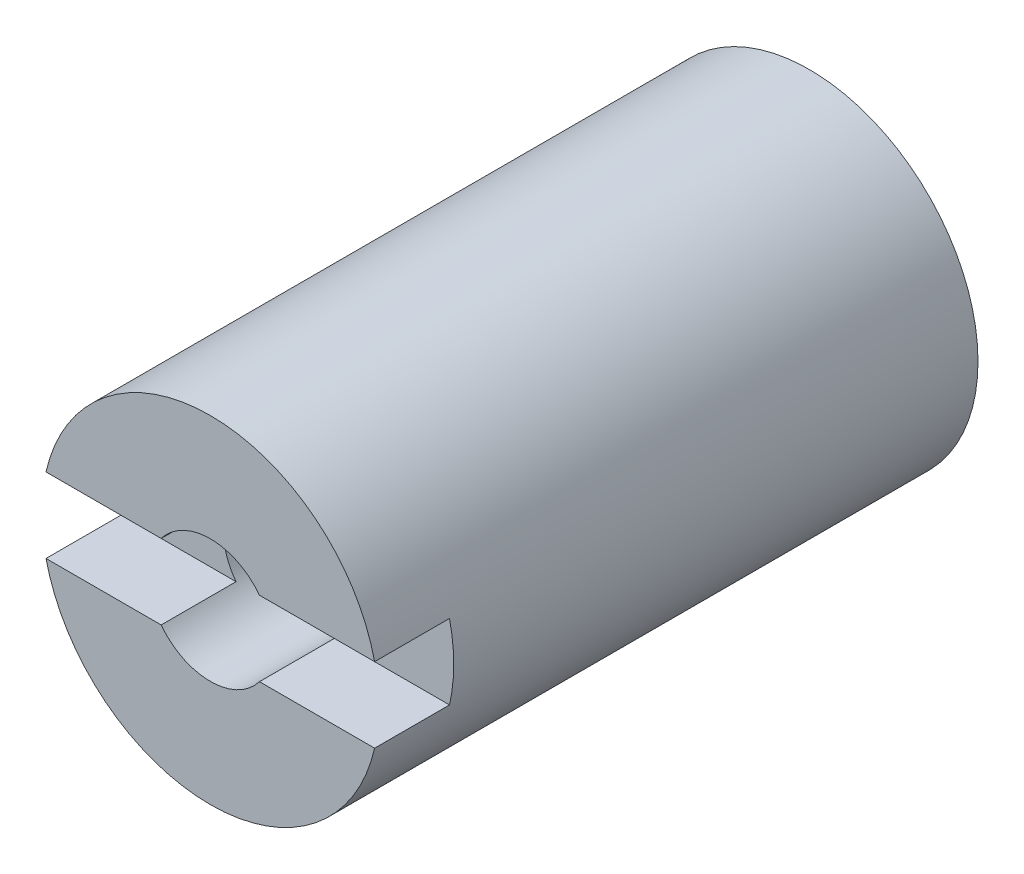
ISO-10303-21;
HEADER;
FILE_DESCRIPTION(('STEP AP214'),'2;1');
FILE_NAME('part.step','',(''),(''),'','','');
FILE_SCHEMA(('AUTOMOTIVE_DESIGN { 1 0 10303 214 1 1 1 1 }'));
ENDSEC;
DATA;
#1=APPLICATION_CONTEXT('core data for automotive mechanical design processes');
#2=APPLICATION_PROTOCOL_DEFINITION('international standard','automotive_design',2000,#1);
#3=PRODUCT_CONTEXT('',#1,'mechanical');
#4=PRODUCT('Part','Part','',(#3));
#5=PRODUCT_RELATED_PRODUCT_CATEGORY('part','',(#4));
#6=PRODUCT_DEFINITION_FORMATION('','',#4);
#7=PRODUCT_DEFINITION_CONTEXT('part definition',#1,'design');
#8=PRODUCT_DEFINITION('design','',#6,#7);
#9=PRODUCT_DEFINITION_SHAPE('','',#8);
#10=(LENGTH_UNIT() NAMED_UNIT(*) SI_UNIT(.MILLI.,.METRE.));
#11=(NAMED_UNIT(*) PLANE_ANGLE_UNIT() SI_UNIT($,.RADIAN.));
#12=(NAMED_UNIT(*) SI_UNIT($,.STERADIAN.) SOLID_ANGLE_UNIT());
#13=UNCERTAINTY_MEASURE_WITH_UNIT(LENGTH_MEASURE(1.E-05),#10,'distance_accuracy_value','');
#14=(GEOMETRIC_REPRESENTATION_CONTEXT(3) GLOBAL_UNCERTAINTY_ASSIGNED_CONTEXT((#13)) GLOBAL_UNIT_ASSIGNED_CONTEXT((#10,
#11,#12)) REPRESENTATION_CONTEXT('',''));
#15=CARTESIAN_POINT('',(0.,0.,0.));
#16=DIRECTION('',(0.,0.,1.));
#17=DIRECTION('',(1.,0.,0.));
#18=AXIS2_PLACEMENT_3D('',#15,#16,#17);
#19=CARTESIAN_POINT('',(0.,0.,0.));
#20=DIRECTION('',(0.,0.,1.));
#21=DIRECTION('',(1.,0.,0.));
#22=AXIS2_PLACEMENT_3D('',#19,#20,#21);
#23=PLANE('',#22);
#24=DIRECTION('',(-1.,0.,0.));
#25=VECTOR('',#24,1.);
#26=CARTESIAN_POINT('',(-4.38748219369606,1.,0.));
#27=LINE('',#26,#25);
#28=CARTESIAN_POINT('',(4.38748219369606,1.,0.));
#29=VERTEX_POINT('',#28);
#30=CARTESIAN_POINT('',(1.31244047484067,0.999999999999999,0.));
#31=VERTEX_POINT('',#30);
#32=EDGE_CURVE('E165',#29,#31,#27,.T.);
#33=ORIENTED_EDGE('',*,*,#32,.F.);
#34=CARTESIAN_POINT('',(0.,0.,0.));
#35=DIRECTION('',(0.,0.,1.));
#36=DIRECTION('',(1.,0.,0.));
#37=AXIS2_PLACEMENT_3D('',#34,#35,#36);
#38=CIRCLE('',#37,4.5);
#39=CARTESIAN_POINT('',(-4.38748219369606,1.,0.));
#40=VERTEX_POINT('',#39);
#41=EDGE_CURVE('E128',#29,#40,#38,.T.);
#42=ORIENTED_EDGE('',*,*,#41,.T.);
#43=CARTESIAN_POINT('',(-1.31244047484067,0.999999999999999,0.));
#44=VERTEX_POINT('',#43);
#45=EDGE_CURVE('E120',#44,#40,#27,.T.);
#46=ORIENTED_EDGE('',*,*,#45,.F.);
#47=CARTESIAN_POINT('',(0.,0.,0.));
#48=DIRECTION('',(0.,0.,1.));
#49=DIRECTION('',(1.,0.,0.));
#50=AXIS2_PLACEMENT_3D('',#47,#48,#49);
#51=CIRCLE('',#50,1.65);
#52=EDGE_CURVE('E129',#31,#44,#51,.T.);
#53=ORIENTED_EDGE('',*,*,#52,.F.);
#54=EDGE_LOOP('',(#33,#42,#46,#53));
#55=FACE_BOUND('',#54,.T.);
#56=ADVANCED_FACE('F38',(#55),#23,.T.);
#57=CARTESIAN_POINT('',(0.,0.,-16.));
#58=DIRECTION('',(0.,0.,1.));
#59=DIRECTION('',(1.,0.,0.));
#60=AXIS2_PLACEMENT_3D('',#57,#58,#59);
#61=CYLINDRICAL_SURFACE('',#60,4.5);
#62=DIRECTION('',(0.,0.,1.));
#63=VECTOR('',#62,1.);
#64=CARTESIAN_POINT('',(-4.38748219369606,1.,-2.));
#65=LINE('',#64,#63);
#66=CARTESIAN_POINT('',(-4.38748219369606,1.,-2.));
#67=VERTEX_POINT('',#66);
#68=EDGE_CURVE('E156',#67,#40,#65,.T.);
#69=ORIENTED_EDGE('',*,*,#68,.T.);
#70=ORIENTED_EDGE('',*,*,#41,.F.);
#71=DIRECTION('',(0.,0.,1.));
#72=VECTOR('',#71,1.);
#73=CARTESIAN_POINT('',(4.38748219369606,1.,-2.));
#74=LINE('',#73,#72);
#75=CARTESIAN_POINT('',(4.38748219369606,1.,-2.));
#76=VERTEX_POINT('',#75);
#77=EDGE_CURVE('E176',#76,#29,#74,.T.);
#78=ORIENTED_EDGE('',*,*,#77,.F.);
#79=CARTESIAN_POINT('',(0.,0.,-2.));
#80=DIRECTION('',(0.,0.,1.));
#81=DIRECTION('',(1.,0.,0.));
#82=AXIS2_PLACEMENT_3D('',#79,#80,#81);
#83=CIRCLE('',#82,4.5);
#84=CARTESIAN_POINT('',(4.38748219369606,-1.,-2.));
#85=VERTEX_POINT('',#84);
#86=EDGE_CURVE('E157',#85,#76,#83,.T.);
#87=ORIENTED_EDGE('',*,*,#86,.F.);
#88=DIRECTION('',(0.,0.,1.));
#89=VECTOR('',#88,1.);
#90=CARTESIAN_POINT('',(4.38748219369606,-1.,-2.));
#91=LINE('',#90,#89);
#92=CARTESIAN_POINT('',(4.38748219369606,-1.,0.));
#93=VERTEX_POINT('',#92);
#94=EDGE_CURVE('E110',#85,#93,#91,.T.);
#95=ORIENTED_EDGE('',*,*,#94,.T.);
#96=CARTESIAN_POINT('',(-4.38748219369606,-1.,0.));
#97=VERTEX_POINT('',#96);
#98=EDGE_CURVE('E117',#97,#93,#38,.T.);
#99=ORIENTED_EDGE('',*,*,#98,.F.);
#100=DIRECTION('',(0.,0.,1.));
#101=VECTOR('',#100,1.);
#102=CARTESIAN_POINT('',(-4.38748219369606,-1.,-2.));
#103=LINE('',#102,#101);
#104=CARTESIAN_POINT('',(-4.38748219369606,-1.,-2.));
#105=VERTEX_POINT('',#104);
#106=EDGE_CURVE('E102',#105,#97,#103,.T.);
#107=ORIENTED_EDGE('',*,*,#106,.F.);
#108=CARTESIAN_POINT('',(0.,0.,-2.));
#109=DIRECTION('',(0.,0.,1.));
#110=DIRECTION('',(1.,0.,0.));
#111=AXIS2_PLACEMENT_3D('',#108,#109,#110);
#112=CIRCLE('',#111,4.5);
#113=EDGE_CURVE('E168',#67,#105,#112,.T.);
#114=ORIENTED_EDGE('',*,*,#113,.F.);
#115=EDGE_LOOP('',(#69,#70,#78,#87,#95,#99,#107,#114));
#116=FACE_BOUND('',#115,.T.);
#117=CARTESIAN_POINT('',(0.,0.,-16.));
#118=DIRECTION('',(0.,0.,1.));
#119=DIRECTION('',(1.,0.,0.));
#120=AXIS2_PLACEMENT_3D('',#117,#118,#119);
#121=CIRCLE('',#120,4.5);
#122=CARTESIAN_POINT('',(4.5,0.,-16.));
#123=VERTEX_POINT('',#122);
#124=EDGE_CURVE('E132',#123,#123,#121,.T.);
#125=ORIENTED_EDGE('',*,*,#124,.T.);
#126=EDGE_LOOP('',(#125));
#127=FACE_BOUND('',#126,.T.);
#128=ADVANCED_FACE('F40',(#116,#127),#61,.T.);
#129=CARTESIAN_POINT('',(0.,0.,-16.));
#130=DIRECTION('',(0.,0.,1.));
#131=DIRECTION('',(1.,0.,0.));
#132=AXIS2_PLACEMENT_3D('',#129,#130,#131);
#133=PLANE('',#132);
#134=CARTESIAN_POINT('',(0.,0.,-16.));
#135=DIRECTION('',(0.,0.,1.));
#136=DIRECTION('',(1.,0.,0.));
#137=AXIS2_PLACEMENT_3D('',#134,#135,#136);
#138=CIRCLE('',#137,1.65);
#139=CARTESIAN_POINT('',(1.65,0.,-16.));
#140=VERTEX_POINT('',#139);
#141=EDGE_CURVE('E175',#140,#140,#138,.T.);
#142=ORIENTED_EDGE('',*,*,#141,.T.);
#143=EDGE_LOOP('',(#142));
#144=FACE_BOUND('',#143,.T.);
#145=ORIENTED_EDGE('',*,*,#124,.F.);
#146=EDGE_LOOP('',(#145));
#147=FACE_BOUND('',#146,.T.);
#148=ADVANCED_FACE('F201',(#144,#147),#133,.F.);
#149=DIRECTION('',(1.,0.,0.));
#150=VECTOR('',#149,1.);
#151=CARTESIAN_POINT('',(-4.38748219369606,-1.,0.));
#152=LINE('',#151,#150);
#153=CARTESIAN_POINT('',(-1.31244047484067,-0.999999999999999,0.));
#154=VERTEX_POINT('',#153);
#155=EDGE_CURVE('E105',#97,#154,#152,.T.);
#156=ORIENTED_EDGE('',*,*,#155,.F.);
#157=ORIENTED_EDGE('',*,*,#98,.T.);
#158=CARTESIAN_POINT('',(1.31244047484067,-0.999999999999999,0.));
#159=VERTEX_POINT('',#158);
#160=EDGE_CURVE('E121',#159,#93,#152,.T.);
#161=ORIENTED_EDGE('',*,*,#160,.F.);
#162=EDGE_CURVE('E119',#154,#159,#51,.T.);
#163=ORIENTED_EDGE('',*,*,#162,.F.);
#164=EDGE_LOOP('',(#156,#157,#161,#163));
#165=FACE_BOUND('',#164,.T.);
#166=ADVANCED_FACE('F115',(#165),#23,.T.);
#167=CARTESIAN_POINT('',(0.,0.,0.));
#168=DIRECTION('',(0.,0.,1.));
#169=DIRECTION('',(1.,0.,0.));
#170=AXIS2_PLACEMENT_3D('',#167,#168,#169);
#171=CYLINDRICAL_SURFACE('',#170,1.65);
#172=ORIENTED_EDGE('',*,*,#52,.T.);
#173=DIRECTION('',(0.,0.,1.));
#174=VECTOR('',#173,1.);
#175=CARTESIAN_POINT('',(-1.31244047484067,1.,0.));
#176=LINE('',#175,#174);
#177=CARTESIAN_POINT('',(-1.31244047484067,0.999999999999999,-2.));
#178=VERTEX_POINT('',#177);
#179=EDGE_CURVE('E11',#44,#178,#176,.F.);
#180=ORIENTED_EDGE('',*,*,#179,.T.);
#181=CARTESIAN_POINT('',(0.,0.,-2.));
#182=DIRECTION('',(0.,0.,1.));
#183=DIRECTION('',(1.,0.,0.));
#184=AXIS2_PLACEMENT_3D('',#181,#182,#183);
#185=CIRCLE('',#184,1.65);
#186=CARTESIAN_POINT('',(-1.31244047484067,-0.999999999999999,-2.));
#187=VERTEX_POINT('',#186);
#188=EDGE_CURVE('E142',#187,#178,#185,.F.);
#189=ORIENTED_EDGE('',*,*,#188,.F.);
#190=DIRECTION('',(0.,0.,1.));
#191=VECTOR('',#190,1.);
#192=CARTESIAN_POINT('',(-1.31244047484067,-1.,0.));
#193=LINE('',#192,#191);
#194=EDGE_CURVE('E46',#187,#154,#193,.T.);
#195=ORIENTED_EDGE('',*,*,#194,.T.);
#196=ORIENTED_EDGE('',*,*,#162,.T.);
#197=DIRECTION('',(0.,0.,1.));
#198=VECTOR('',#197,1.);
#199=CARTESIAN_POINT('',(1.31244047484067,-1.,0.));
#200=LINE('',#199,#198);
#201=CARTESIAN_POINT('',(1.31244047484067,-0.999999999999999,-2.));
#202=VERTEX_POINT('',#201);
#203=EDGE_CURVE('E141',#159,#202,#200,.F.);
#204=ORIENTED_EDGE('',*,*,#203,.T.);
#205=CARTESIAN_POINT('',(1.31244047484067,0.999999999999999,-2.));
#206=VERTEX_POINT('',#205);
#207=EDGE_CURVE('E139',#206,#202,#185,.F.);
#208=ORIENTED_EDGE('',*,*,#207,.F.);
#209=DIRECTION('',(0.,0.,1.));
#210=VECTOR('',#209,1.);
#211=CARTESIAN_POINT('',(1.31244047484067,1.,0.));
#212=LINE('',#211,#210);
#213=EDGE_CURVE('E145',#206,#31,#212,.T.);
#214=ORIENTED_EDGE('',*,*,#213,.T.);
#215=EDGE_LOOP('',(#172,#180,#189,#195,#196,#204,#208,#214));
#216=FACE_BOUND('',#215,.T.);
#217=ORIENTED_EDGE('',*,*,#141,.F.);
#218=EDGE_LOOP('',(#217));
#219=FACE_BOUND('',#218,.T.);
#220=ADVANCED_FACE('F159',(#216,#219),#171,.F.);
#221=CARTESIAN_POINT('',(0.,0.,-2.));
#222=DIRECTION('',(0.,0.,1.));
#223=DIRECTION('',(1.,0.,0.));
#224=AXIS2_PLACEMENT_3D('',#221,#222,#223);
#225=PLANE('',#224);
#226=ORIENTED_EDGE('',*,*,#207,.T.);
#227=DIRECTION('',(1.,0.,0.));
#228=VECTOR('',#227,1.);
#229=CARTESIAN_POINT('',(-4.38748219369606,-1.,-2.));
#230=LINE('',#229,#228);
#231=EDGE_CURVE('E171',#202,#85,#230,.T.);
#232=ORIENTED_EDGE('',*,*,#231,.T.);
#233=ORIENTED_EDGE('',*,*,#86,.T.);
#234=DIRECTION('',(-1.,0.,0.));
#235=VECTOR('',#234,1.);
#236=CARTESIAN_POINT('',(-4.38748219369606,1.,-2.));
#237=LINE('',#236,#235);
#238=EDGE_CURVE('E61',#76,#206,#237,.T.);
#239=ORIENTED_EDGE('',*,*,#238,.T.);
#240=EDGE_LOOP('',(#226,#232,#233,#239));
#241=FACE_BOUND('',#240,.T.);
#242=ADVANCED_FACE('F184',(#241),#225,.T.);
#243=CARTESIAN_POINT('',(-4.38748219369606,-1.,-2.));
#244=DIRECTION('',(0.,-1.,0.));
#245=DIRECTION('',(1.,0.,0.));
#246=AXIS2_PLACEMENT_3D('',#243,#244,#245);
#247=PLANE('',#246);
#248=ORIENTED_EDGE('',*,*,#160,.T.);
#249=ORIENTED_EDGE('',*,*,#94,.F.);
#250=ORIENTED_EDGE('',*,*,#231,.F.);
#251=ORIENTED_EDGE('',*,*,#203,.F.);
#252=EDGE_LOOP('',(#248,#249,#250,#251));
#253=FACE_BOUND('',#252,.T.);
#254=ADVANCED_FACE('F183',(#253),#247,.F.);
#255=CARTESIAN_POINT('',(-4.38748219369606,1.,-2.));
#256=DIRECTION('',(0.,1.,0.));
#257=DIRECTION('',(-1.,0.,0.));
#258=AXIS2_PLACEMENT_3D('',#255,#256,#257);
#259=PLANE('',#258);
#260=ORIENTED_EDGE('',*,*,#238,.F.);
#261=ORIENTED_EDGE('',*,*,#77,.T.);
#262=ORIENTED_EDGE('',*,*,#32,.T.);
#263=ORIENTED_EDGE('',*,*,#213,.F.);
#264=EDGE_LOOP('',(#260,#261,#262,#263));
#265=FACE_BOUND('',#264,.T.);
#266=ADVANCED_FACE('F187',(#265),#259,.F.);
#267=ORIENTED_EDGE('',*,*,#45,.T.);
#268=ORIENTED_EDGE('',*,*,#68,.F.);
#269=EDGE_CURVE('E151',#178,#67,#237,.T.);
#270=ORIENTED_EDGE('',*,*,#269,.F.);
#271=ORIENTED_EDGE('',*,*,#179,.F.);
#272=EDGE_LOOP('',(#267,#268,#270,#271));
#273=FACE_BOUND('',#272,.T.);
#274=ADVANCED_FACE('F154',(#273),#259,.F.);
#275=EDGE_CURVE('E53',#105,#187,#230,.T.);
#276=ORIENTED_EDGE('',*,*,#275,.F.);
#277=ORIENTED_EDGE('',*,*,#106,.T.);
#278=ORIENTED_EDGE('',*,*,#155,.T.);
#279=ORIENTED_EDGE('',*,*,#194,.F.);
#280=EDGE_LOOP('',(#276,#277,#278,#279));
#281=FACE_BOUND('',#280,.T.);
#282=ADVANCED_FACE('F104',(#281),#247,.F.);
#283=ORIENTED_EDGE('',*,*,#188,.T.);
#284=ORIENTED_EDGE('',*,*,#269,.T.);
#285=ORIENTED_EDGE('',*,*,#113,.T.);
#286=ORIENTED_EDGE('',*,*,#275,.T.);
#287=EDGE_LOOP('',(#283,#284,#285,#286));
#288=FACE_BOUND('',#287,.T.);
#289=ADVANCED_FACE('F150',(#288),#225,.T.);
#290=CLOSED_SHELL('',(#56,#128,#148,#166,#220,#242,#254,#266,#274,#282,#289));
#291=MANIFOLD_SOLID_BREP('B2',#290);
#292=ADVANCED_BREP_SHAPE_REPRESENTATION('',(#18,#291),#14);
#293=SHAPE_DEFINITION_REPRESENTATION(#9,#292);
ENDSEC;
END-ISO-10303-21;
